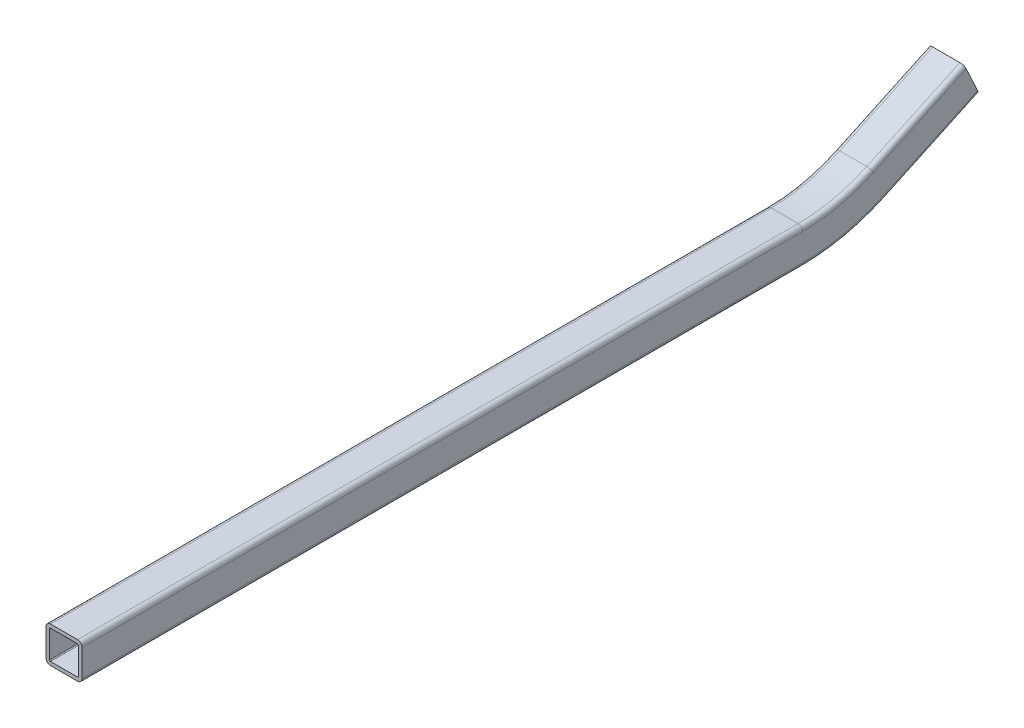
from build123d import *


with BuildPart() as part:
    # Balayage1: sweep along a path in Esquisse3
    with BuildLine(Plane(origin=(0, 0, 0), x_dir=(0, 0, -1), z_dir=(1, 0, 0))) as balayage1_path:
        Line((0, 0), (400, 0))
        ThreePointArc((400, 0), (421.643961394, 2.370399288), (442.261826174, 9.369221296))
        Line((442.261826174, 9.369221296), (493.921370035, 33.458462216))
    # Esquisse2 → Balayage1 (sweep)
    with BuildSketch(Plane.XY):
        with BuildLine():
            Line((-7.5, 10), (7.5, 10))
            ThreePointArc((7.5, 10), (9.267766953, 9.267766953), (10, 7.5))
            Line((10, 7.5), (10, -7.5))
            ThreePointArc((10, -7.5), (9.267766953, -9.267766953), (7.5, -10))
            Line((7.5, -10), (-7.5, -10))
            ThreePointArc((-7.5, -10), (-9.267766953, -9.267766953), (-10, -7.5))
            Line((-10, -7.5), (-10, 7.5))
            ThreePointArc((-10, 7.5), (-9.267766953, 9.267766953), (-7.5, 10))
        make_face()
        with BuildLine():
            Line((-7.5, 8), (7.5, 8))
            ThreePointArc((7.5, 8), (7.853553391, 7.853553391), (8, 7.5))
            Line((8, 7.5), (8, -7.5))
            ThreePointArc((8, -7.5), (7.853553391, -7.853553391), (7.5, -8))
            Line((7.5, -8), (-7.5, -8))
            ThreePointArc((-7.5, -8), (-7.853553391, -7.853553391), (-8, -7.5))
            Line((-8, -7.5), (-8, 7.5))
            ThreePointArc((-8, 7.5), (-7.853553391, 7.853553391), (-7.5, 8))
        make_face(mode=Mode.SUBTRACT)
    sweep(path=balayage1_path.line)


solid = part.part
